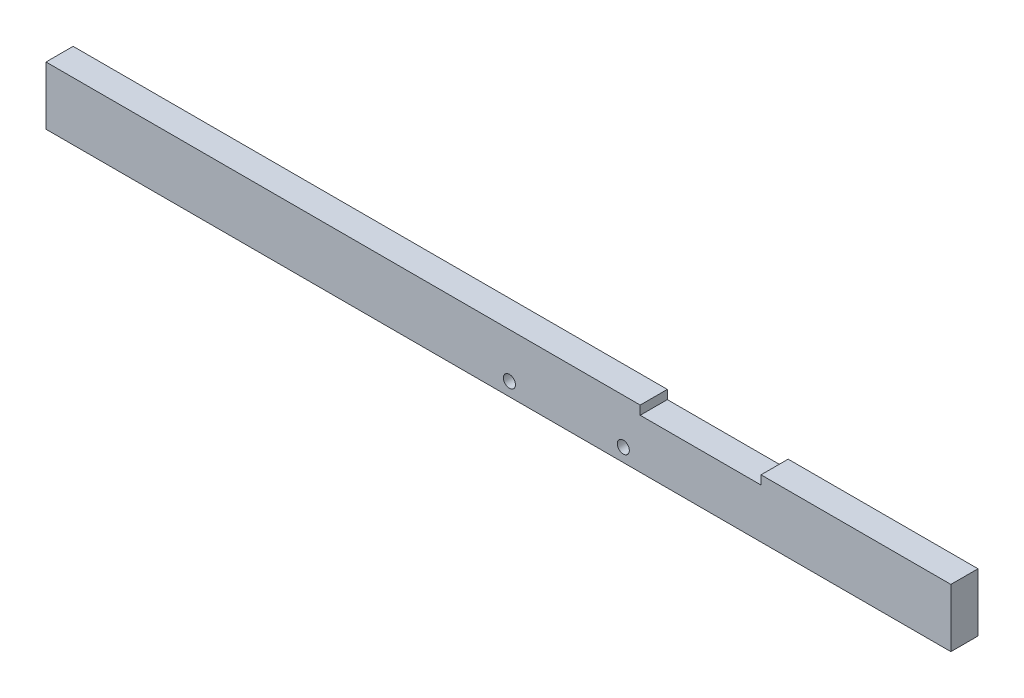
ISO-10303-21;
HEADER;
FILE_DESCRIPTION(('STEP AP214'),'2;1');
FILE_NAME('part.step','',(''),(''),'','','');
FILE_SCHEMA(('AUTOMOTIVE_DESIGN { 1 0 10303 214 1 1 1 1 }'));
ENDSEC;
DATA;
#1=APPLICATION_CONTEXT('core data for automotive mechanical design processes');
#2=APPLICATION_PROTOCOL_DEFINITION('international standard','automotive_design',2000,#1);
#3=PRODUCT_CONTEXT('',#1,'mechanical');
#4=PRODUCT('Part','Part','',(#3));
#5=PRODUCT_RELATED_PRODUCT_CATEGORY('part','',(#4));
#6=PRODUCT_DEFINITION_FORMATION('','',#4);
#7=PRODUCT_DEFINITION_CONTEXT('part definition',#1,'design');
#8=PRODUCT_DEFINITION('design','',#6,#7);
#9=PRODUCT_DEFINITION_SHAPE('','',#8);
#10=(LENGTH_UNIT() NAMED_UNIT(*) SI_UNIT(.MILLI.,.METRE.));
#11=(NAMED_UNIT(*) PLANE_ANGLE_UNIT() SI_UNIT($,.RADIAN.));
#12=(NAMED_UNIT(*) SI_UNIT($,.STERADIAN.) SOLID_ANGLE_UNIT());
#13=UNCERTAINTY_MEASURE_WITH_UNIT(LENGTH_MEASURE(1.E-05),#10,'distance_accuracy_value','');
#14=(GEOMETRIC_REPRESENTATION_CONTEXT(3) GLOBAL_UNCERTAINTY_ASSIGNED_CONTEXT((#13)) GLOBAL_UNIT_ASSIGNED_CONTEXT((#10,
#11,#12)) REPRESENTATION_CONTEXT('',''));
#15=CARTESIAN_POINT('',(0.,0.,0.));
#16=DIRECTION('',(0.,0.,1.));
#17=DIRECTION('',(1.,0.,0.));
#18=AXIS2_PLACEMENT_3D('',#15,#16,#17);
#19=CARTESIAN_POINT('',(337.,-1.13686837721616E-13,10.1));
#20=DIRECTION('',(0.,0.,1.));
#21=DIRECTION('',(1.,0.,0.));
#22=AXIS2_PLACEMENT_3D('',#19,#20,#21);
#23=PLANE('',#22);
#24=CARTESIAN_POINT('',(215.,4.99999999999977,10.1));
#25=DIRECTION('',(0.,0.,1.));
#26=DIRECTION('',(1.,0.,0.));
#27=AXIS2_PLACEMENT_3D('',#24,#25,#26);
#28=CIRCLE('',#27,2.25);
#29=CARTESIAN_POINT('',(217.25,4.99999999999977,10.1));
#30=VERTEX_POINT('',#29);
#31=EDGE_CURVE('E132',#30,#30,#28,.T.);
#32=ORIENTED_EDGE('',*,*,#31,.F.);
#33=EDGE_LOOP('',(#32));
#34=FACE_BOUND('',#33,.T.);
#35=DIRECTION('',(1.,0.,0.));
#36=VECTOR('',#35,1.);
#37=CARTESIAN_POINT('',(0.,0.,10.1));
#38=LINE('',#37,#36);
#39=CARTESIAN_POINT('',(0.,0.,10.1));
#40=VERTEX_POINT('',#39);
#41=CARTESIAN_POINT('',(337.,-1.13686837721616E-13,10.1));
#42=VERTEX_POINT('',#41);
#43=EDGE_CURVE('E143',#40,#42,#38,.T.);
#44=ORIENTED_EDGE('',*,*,#43,.T.);
#45=DIRECTION('',(0.,1.,0.));
#46=VECTOR('',#45,1.);
#47=CARTESIAN_POINT('',(337.,-1.13686837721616E-13,10.1));
#48=LINE('',#47,#46);
#49=CARTESIAN_POINT('',(337.,21.6999999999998,10.1));
#50=VERTEX_POINT('',#49);
#51=EDGE_CURVE('E91',#42,#50,#48,.T.);
#52=ORIENTED_EDGE('',*,*,#51,.T.);
#53=DIRECTION('',(-1.,0.,0.));
#54=VECTOR('',#53,1.);
#55=CARTESIAN_POINT('',(266.299999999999,21.6999999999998,10.1));
#56=LINE('',#55,#54);
#57=CARTESIAN_POINT('',(266.299999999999,21.6999999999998,10.1));
#58=VERTEX_POINT('',#57);
#59=EDGE_CURVE('E158',#50,#58,#56,.T.);
#60=ORIENTED_EDGE('',*,*,#59,.T.);
#61=DIRECTION('',(0.,-1.,0.));
#62=VECTOR('',#61,1.);
#63=CARTESIAN_POINT('',(266.299999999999,18.4,10.1));
#64=LINE('',#63,#62);
#65=CARTESIAN_POINT('',(266.299999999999,18.4,10.1));
#66=VERTEX_POINT('',#65);
#67=EDGE_CURVE('E171',#58,#66,#64,.T.);
#68=ORIENTED_EDGE('',*,*,#67,.T.);
#69=DIRECTION('',(-1.,0.,0.));
#70=VECTOR('',#69,1.);
#71=CARTESIAN_POINT('',(221.299999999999,18.4,10.1));
#72=LINE('',#71,#70);
#73=CARTESIAN_POINT('',(221.299999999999,18.4,10.1));
#74=VERTEX_POINT('',#73);
#75=EDGE_CURVE('E110',#66,#74,#72,.T.);
#76=ORIENTED_EDGE('',*,*,#75,.T.);
#77=DIRECTION('',(0.,1.,0.));
#78=VECTOR('',#77,1.);
#79=CARTESIAN_POINT('',(221.299999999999,18.4,10.1));
#80=LINE('',#79,#78);
#81=CARTESIAN_POINT('',(221.299999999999,21.6999999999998,10.1));
#82=VERTEX_POINT('',#81);
#83=EDGE_CURVE('E104',#74,#82,#80,.T.);
#84=ORIENTED_EDGE('',*,*,#83,.T.);
#85=DIRECTION('',(-1.,0.,0.));
#86=VECTOR('',#85,1.);
#87=CARTESIAN_POINT('',(0.,21.6999999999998,10.1));
#88=LINE('',#87,#86);
#89=CARTESIAN_POINT('',(0.,21.6999999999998,10.1));
#90=VERTEX_POINT('',#89);
#91=EDGE_CURVE('E108',#82,#90,#88,.T.);
#92=ORIENTED_EDGE('',*,*,#91,.T.);
#93=DIRECTION('',(0.,-1.,0.));
#94=VECTOR('',#93,1.);
#95=CARTESIAN_POINT('',(0.,0.,10.1));
#96=LINE('',#95,#94);
#97=EDGE_CURVE('E48',#90,#40,#96,.T.);
#98=ORIENTED_EDGE('',*,*,#97,.T.);
#99=EDGE_LOOP('',(#44,#52,#60,#68,#76,#84,#92,#98));
#100=FACE_BOUND('',#99,.T.);
#101=CARTESIAN_POINT('',(172.599999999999,4.99999999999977,10.1));
#102=DIRECTION('',(0.,0.,1.));
#103=DIRECTION('',(1.,0.,0.));
#104=AXIS2_PLACEMENT_3D('',#101,#102,#103);
#105=CIRCLE('',#104,2.25);
#106=CARTESIAN_POINT('',(174.849999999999,4.99999999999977,10.1));
#107=VERTEX_POINT('',#106);
#108=EDGE_CURVE('E180',#107,#107,#105,.T.);
#109=ORIENTED_EDGE('',*,*,#108,.F.);
#110=EDGE_LOOP('',(#109));
#111=FACE_BOUND('',#110,.T.);
#112=ADVANCED_FACE('F31',(#34,#100,#111),#23,.T.);
#113=CARTESIAN_POINT('',(337.,-1.13686837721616E-13,0.));
#114=DIRECTION('',(0.,0.,1.));
#115=DIRECTION('',(1.,0.,0.));
#116=AXIS2_PLACEMENT_3D('',#113,#114,#115);
#117=PLANE('',#116);
#118=CARTESIAN_POINT('',(215.,4.99999999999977,0.));
#119=DIRECTION('',(0.,0.,1.));
#120=DIRECTION('',(1.,0.,0.));
#121=AXIS2_PLACEMENT_3D('',#118,#119,#120);
#122=CIRCLE('',#121,2.25);
#123=CARTESIAN_POINT('',(217.25,4.99999999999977,0.));
#124=VERTEX_POINT('',#123);
#125=EDGE_CURVE('E177',#124,#124,#122,.T.);
#126=ORIENTED_EDGE('',*,*,#125,.T.);
#127=EDGE_LOOP('',(#126));
#128=FACE_BOUND('',#127,.T.);
#129=DIRECTION('',(1.,0.,0.));
#130=VECTOR('',#129,1.);
#131=CARTESIAN_POINT('',(0.,0.,0.));
#132=LINE('',#131,#130);
#133=CARTESIAN_POINT('',(0.,0.,0.));
#134=VERTEX_POINT('',#133);
#135=CARTESIAN_POINT('',(337.,-1.13686837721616E-13,0.));
#136=VERTEX_POINT('',#135);
#137=EDGE_CURVE('E128',#134,#136,#132,.T.);
#138=ORIENTED_EDGE('',*,*,#137,.F.);
#139=DIRECTION('',(0.,-1.,0.));
#140=VECTOR('',#139,1.);
#141=CARTESIAN_POINT('',(0.,0.,0.));
#142=LINE('',#141,#140);
#143=CARTESIAN_POINT('',(0.,21.6999999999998,0.));
#144=VERTEX_POINT('',#143);
#145=EDGE_CURVE('E83',#144,#134,#142,.T.);
#146=ORIENTED_EDGE('',*,*,#145,.F.);
#147=DIRECTION('',(-1.,0.,0.));
#148=VECTOR('',#147,1.);
#149=CARTESIAN_POINT('',(0.,21.6999999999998,0.));
#150=LINE('',#149,#148);
#151=CARTESIAN_POINT('',(221.299999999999,21.6999999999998,0.));
#152=VERTEX_POINT('',#151);
#153=EDGE_CURVE('E77',#152,#144,#150,.T.);
#154=ORIENTED_EDGE('',*,*,#153,.F.);
#155=DIRECTION('',(0.,1.,0.));
#156=VECTOR('',#155,1.);
#157=CARTESIAN_POINT('',(221.299999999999,18.4,0.));
#158=LINE('',#157,#156);
#159=CARTESIAN_POINT('',(221.299999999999,18.4,0.));
#160=VERTEX_POINT('',#159);
#161=EDGE_CURVE('E118',#160,#152,#158,.T.);
#162=ORIENTED_EDGE('',*,*,#161,.F.);
#163=DIRECTION('',(-1.,0.,0.));
#164=VECTOR('',#163,1.);
#165=CARTESIAN_POINT('',(221.299999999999,18.4,0.));
#166=LINE('',#165,#164);
#167=CARTESIAN_POINT('',(266.299999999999,18.4,0.));
#168=VERTEX_POINT('',#167);
#169=EDGE_CURVE('E138',#168,#160,#166,.T.);
#170=ORIENTED_EDGE('',*,*,#169,.F.);
#171=DIRECTION('',(0.,-1.,0.));
#172=VECTOR('',#171,1.);
#173=CARTESIAN_POINT('',(266.299999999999,18.4,0.));
#174=LINE('',#173,#172);
#175=CARTESIAN_POINT('',(266.299999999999,21.6999999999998,0.));
#176=VERTEX_POINT('',#175);
#177=EDGE_CURVE('E136',#176,#168,#174,.T.);
#178=ORIENTED_EDGE('',*,*,#177,.F.);
#179=DIRECTION('',(-1.,0.,0.));
#180=VECTOR('',#179,1.);
#181=CARTESIAN_POINT('',(266.299999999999,21.6999999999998,0.));
#182=LINE('',#181,#180);
#183=CARTESIAN_POINT('',(337.,21.6999999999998,0.));
#184=VERTEX_POINT('',#183);
#185=EDGE_CURVE('E134',#184,#176,#182,.T.);
#186=ORIENTED_EDGE('',*,*,#185,.F.);
#187=DIRECTION('',(0.,1.,0.));
#188=VECTOR('',#187,1.);
#189=CARTESIAN_POINT('',(337.,-1.13686837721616E-13,0.));
#190=LINE('',#189,#188);
#191=EDGE_CURVE('E131',#136,#184,#190,.T.);
#192=ORIENTED_EDGE('',*,*,#191,.F.);
#193=EDGE_LOOP('',(#138,#146,#154,#162,#170,#178,#186,#192));
#194=FACE_BOUND('',#193,.T.);
#195=CARTESIAN_POINT('',(172.599999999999,4.99999999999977,0.));
#196=DIRECTION('',(0.,0.,1.));
#197=DIRECTION('',(1.,0.,0.));
#198=AXIS2_PLACEMENT_3D('',#195,#196,#197);
#199=CIRCLE('',#198,2.25);
#200=CARTESIAN_POINT('',(174.849999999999,4.99999999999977,0.));
#201=VERTEX_POINT('',#200);
#202=EDGE_CURVE('E183',#201,#201,#199,.T.);
#203=ORIENTED_EDGE('',*,*,#202,.T.);
#204=EDGE_LOOP('',(#203));
#205=FACE_BOUND('',#204,.T.);
#206=ADVANCED_FACE('F162',(#128,#194,#205),#117,.F.);
#207=CARTESIAN_POINT('',(0.,0.,10.1));
#208=DIRECTION('',(0.,1.,0.));
#209=DIRECTION('',(-1.,0.,0.));
#210=AXIS2_PLACEMENT_3D('',#207,#208,#209);
#211=PLANE('',#210);
#212=ORIENTED_EDGE('',*,*,#137,.T.);
#213=DIRECTION('',(0.,0.,-1.));
#214=VECTOR('',#213,1.);
#215=CARTESIAN_POINT('',(337.,-1.13686837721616E-13,10.1));
#216=LINE('',#215,#214);
#217=EDGE_CURVE('E11',#42,#136,#216,.T.);
#218=ORIENTED_EDGE('',*,*,#217,.F.);
#219=ORIENTED_EDGE('',*,*,#43,.F.);
#220=DIRECTION('',(0.,0.,-1.));
#221=VECTOR('',#220,1.);
#222=CARTESIAN_POINT('',(0.,0.,10.1));
#223=LINE('',#222,#221);
#224=EDGE_CURVE('E124',#40,#134,#223,.T.);
#225=ORIENTED_EDGE('',*,*,#224,.T.);
#226=EDGE_LOOP('',(#212,#218,#219,#225));
#227=FACE_BOUND('',#226,.T.);
#228=ADVANCED_FACE('F33',(#227),#211,.F.);
#229=CARTESIAN_POINT('',(337.,-1.13686837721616E-13,10.1));
#230=DIRECTION('',(-1.,0.,0.));
#231=DIRECTION('',(0.,0.,1.));
#232=AXIS2_PLACEMENT_3D('',#229,#230,#231);
#233=PLANE('',#232);
#234=ORIENTED_EDGE('',*,*,#191,.T.);
#235=DIRECTION('',(0.,0.,-1.));
#236=VECTOR('',#235,1.);
#237=CARTESIAN_POINT('',(337.,21.6999999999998,10.1));
#238=LINE('',#237,#236);
#239=EDGE_CURVE('E40',#50,#184,#238,.T.);
#240=ORIENTED_EDGE('',*,*,#239,.F.);
#241=ORIENTED_EDGE('',*,*,#51,.F.);
#242=ORIENTED_EDGE('',*,*,#217,.T.);
#243=EDGE_LOOP('',(#234,#240,#241,#242));
#244=FACE_BOUND('',#243,.T.);
#245=ADVANCED_FACE('F216',(#244),#233,.F.);
#246=CARTESIAN_POINT('',(266.299999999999,21.6999999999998,10.1));
#247=DIRECTION('',(0.,-1.,0.));
#248=DIRECTION('',(0.,0.,-1.));
#249=AXIS2_PLACEMENT_3D('',#246,#247,#248);
#250=PLANE('',#249);
#251=ORIENTED_EDGE('',*,*,#185,.T.);
#252=DIRECTION('',(0.,0.,-1.));
#253=VECTOR('',#252,1.);
#254=CARTESIAN_POINT('',(266.299999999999,21.6999999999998,10.1));
#255=LINE('',#254,#253);
#256=EDGE_CURVE('E150',#58,#176,#255,.T.);
#257=ORIENTED_EDGE('',*,*,#256,.F.);
#258=ORIENTED_EDGE('',*,*,#59,.F.);
#259=ORIENTED_EDGE('',*,*,#239,.T.);
#260=EDGE_LOOP('',(#251,#257,#258,#259));
#261=FACE_BOUND('',#260,.T.);
#262=ADVANCED_FACE('F156',(#261),#250,.F.);
#263=CARTESIAN_POINT('',(266.299999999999,18.4,10.1));
#264=DIRECTION('',(1.,0.,0.));
#265=DIRECTION('',(0.,0.,-1.));
#266=AXIS2_PLACEMENT_3D('',#263,#264,#265);
#267=PLANE('',#266);
#268=ORIENTED_EDGE('',*,*,#177,.T.);
#269=DIRECTION('',(0.,0.,-1.));
#270=VECTOR('',#269,1.);
#271=CARTESIAN_POINT('',(266.299999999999,18.4,10.1));
#272=LINE('',#271,#270);
#273=EDGE_CURVE('E147',#66,#168,#272,.T.);
#274=ORIENTED_EDGE('',*,*,#273,.F.);
#275=ORIENTED_EDGE('',*,*,#67,.F.);
#276=ORIENTED_EDGE('',*,*,#256,.T.);
#277=EDGE_LOOP('',(#268,#274,#275,#276));
#278=FACE_BOUND('',#277,.T.);
#279=ADVANCED_FACE('F167',(#278),#267,.F.);
#280=CARTESIAN_POINT('',(221.299999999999,18.4,10.1));
#281=DIRECTION('',(0.,-1.,0.));
#282=DIRECTION('',(0.,0.,-1.));
#283=AXIS2_PLACEMENT_3D('',#280,#281,#282);
#284=PLANE('',#283);
#285=ORIENTED_EDGE('',*,*,#169,.T.);
#286=DIRECTION('',(0.,0.,-1.));
#287=VECTOR('',#286,1.);
#288=CARTESIAN_POINT('',(221.299999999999,18.4,10.1));
#289=LINE('',#288,#287);
#290=EDGE_CURVE('E119',#74,#160,#289,.T.);
#291=ORIENTED_EDGE('',*,*,#290,.F.);
#292=ORIENTED_EDGE('',*,*,#75,.F.);
#293=ORIENTED_EDGE('',*,*,#273,.T.);
#294=EDGE_LOOP('',(#285,#291,#292,#293));
#295=FACE_BOUND('',#294,.T.);
#296=ADVANCED_FACE('F170',(#295),#284,.F.);
#297=CARTESIAN_POINT('',(221.299999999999,18.4,10.1));
#298=DIRECTION('',(-1.,0.,0.));
#299=DIRECTION('',(0.,0.,1.));
#300=AXIS2_PLACEMENT_3D('',#297,#298,#299);
#301=PLANE('',#300);
#302=ORIENTED_EDGE('',*,*,#161,.T.);
#303=DIRECTION('',(0.,0.,-1.));
#304=VECTOR('',#303,1.);
#305=CARTESIAN_POINT('',(221.299999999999,21.6999999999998,10.1));
#306=LINE('',#305,#304);
#307=EDGE_CURVE('E115',#82,#152,#306,.T.);
#308=ORIENTED_EDGE('',*,*,#307,.F.);
#309=ORIENTED_EDGE('',*,*,#83,.F.);
#310=ORIENTED_EDGE('',*,*,#290,.T.);
#311=EDGE_LOOP('',(#302,#308,#309,#310));
#312=FACE_BOUND('',#311,.T.);
#313=ADVANCED_FACE('F116',(#312),#301,.F.);
#314=CARTESIAN_POINT('',(0.,21.6999999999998,10.1));
#315=DIRECTION('',(0.,-1.,0.));
#316=DIRECTION('',(0.,0.,-1.));
#317=AXIS2_PLACEMENT_3D('',#314,#315,#316);
#318=PLANE('',#317);
#319=ORIENTED_EDGE('',*,*,#153,.T.);
#320=DIRECTION('',(0.,0.,-1.));
#321=VECTOR('',#320,1.);
#322=CARTESIAN_POINT('',(0.,21.6999999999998,10.1));
#323=LINE('',#322,#321);
#324=EDGE_CURVE('E120',#90,#144,#323,.T.);
#325=ORIENTED_EDGE('',*,*,#324,.F.);
#326=ORIENTED_EDGE('',*,*,#91,.F.);
#327=ORIENTED_EDGE('',*,*,#307,.T.);
#328=EDGE_LOOP('',(#319,#325,#326,#327));
#329=FACE_BOUND('',#328,.T.);
#330=ADVANCED_FACE('F122',(#329),#318,.F.);
#331=CARTESIAN_POINT('',(0.,0.,10.1));
#332=DIRECTION('',(1.,0.,0.));
#333=DIRECTION('',(0.,0.,-1.));
#334=AXIS2_PLACEMENT_3D('',#331,#332,#333);
#335=PLANE('',#334);
#336=ORIENTED_EDGE('',*,*,#145,.T.);
#337=ORIENTED_EDGE('',*,*,#224,.F.);
#338=ORIENTED_EDGE('',*,*,#97,.F.);
#339=ORIENTED_EDGE('',*,*,#324,.T.);
#340=EDGE_LOOP('',(#336,#337,#338,#339));
#341=FACE_BOUND('',#340,.T.);
#342=ADVANCED_FACE('F204',(#341),#335,.F.);
#343=CARTESIAN_POINT('',(215.,4.99999999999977,10.1));
#344=DIRECTION('',(0.,0.,-1.));
#345=DIRECTION('',(-1.,0.,0.));
#346=AXIS2_PLACEMENT_3D('',#343,#344,#345);
#347=CYLINDRICAL_SURFACE('',#346,2.25);
#348=ORIENTED_EDGE('',*,*,#31,.T.);
#349=EDGE_LOOP('',(#348));
#350=FACE_BOUND('',#349,.T.);
#351=ORIENTED_EDGE('',*,*,#125,.F.);
#352=EDGE_LOOP('',(#351));
#353=FACE_BOUND('',#352,.T.);
#354=ADVANCED_FACE('F201',(#350,#353),#347,.F.);
#355=CARTESIAN_POINT('',(172.599999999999,4.99999999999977,10.1));
#356=DIRECTION('',(0.,0.,-1.));
#357=DIRECTION('',(-1.,0.,0.));
#358=AXIS2_PLACEMENT_3D('',#355,#356,#357);
#359=CYLINDRICAL_SURFACE('',#358,2.25);
#360=ORIENTED_EDGE('',*,*,#108,.T.);
#361=EDGE_LOOP('',(#360));
#362=FACE_BOUND('',#361,.T.);
#363=ORIENTED_EDGE('',*,*,#202,.F.);
#364=EDGE_LOOP('',(#363));
#365=FACE_BOUND('',#364,.T.);
#366=ADVANCED_FACE('F189',(#362,#365),#359,.F.);
#367=CLOSED_SHELL('',(#112,#206,#228,#245,#262,#279,#296,#313,#330,#342,#354,#366));
#368=MANIFOLD_SOLID_BREP('B2',#367);
#369=ADVANCED_BREP_SHAPE_REPRESENTATION('',(#18,#368),#14);
#370=SHAPE_DEFINITION_REPRESENTATION(#9,#369);
ENDSEC;
END-ISO-10303-21;
